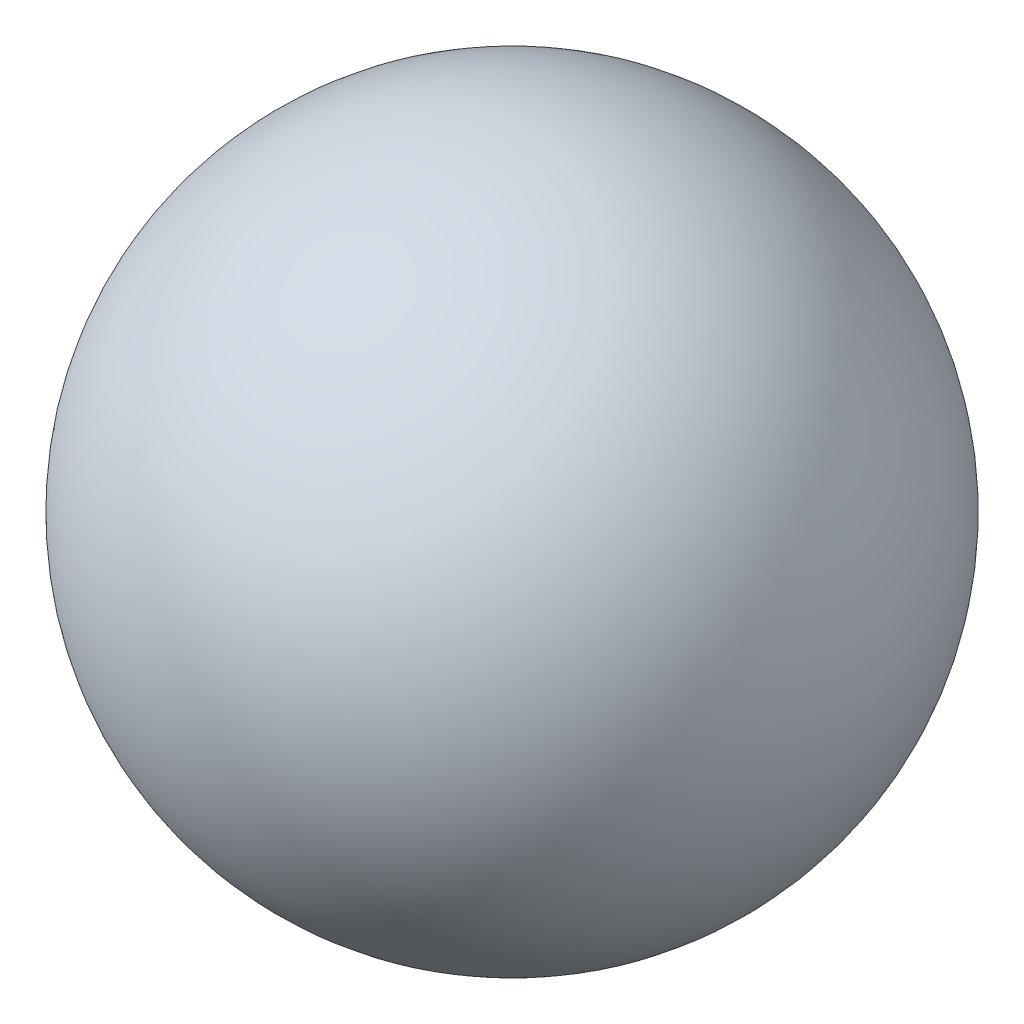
from build123d import *


with BuildPart() as part:
    # Esquisse1 → R_volution1 (revolve)
    with BuildSketch(Plane.XY):
        with BuildLine():
            Line((0, 13.5), (0, -13.5))
            ThreePointArc((0, -13.5), (-13.5, 0), (0, 13.5))
        make_face()
    revolve(axis=Axis((0, 58.130342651, 0), (0, -1, 0)))


solid = part.part
